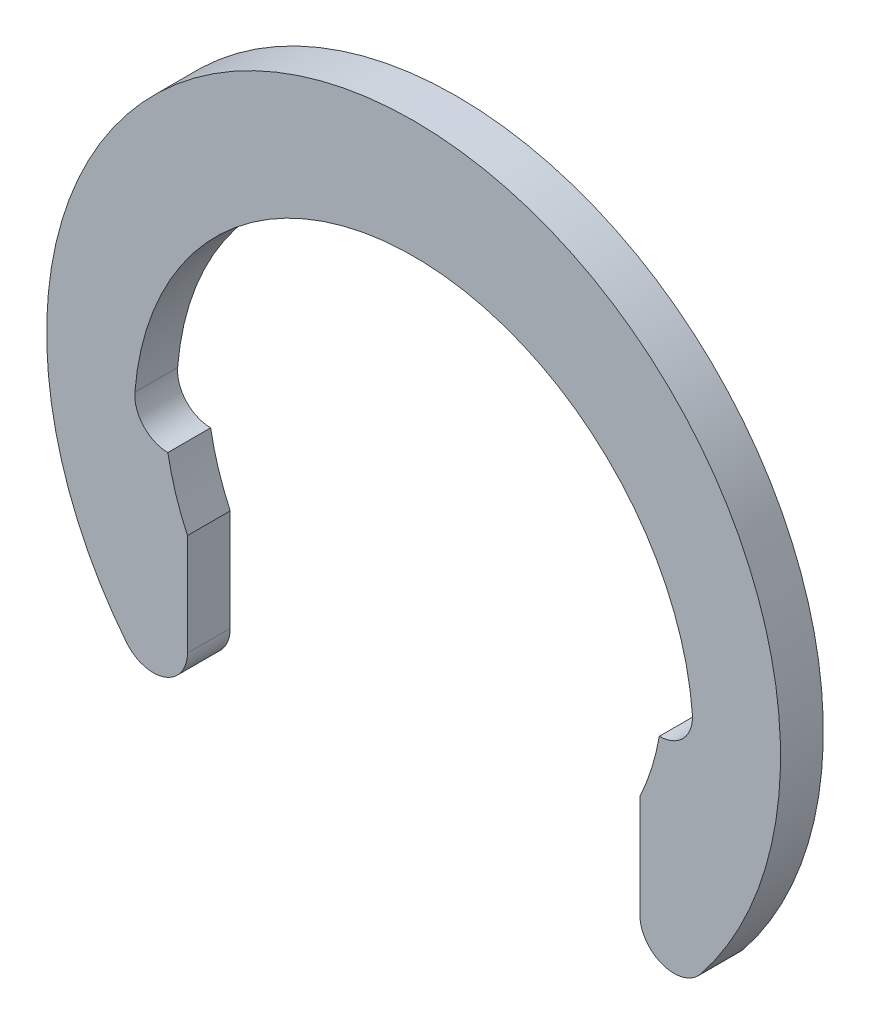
from build123d import *

# Parameters (mm, degrees)
BODY_DEPTH = 0.6


with BuildPart() as part:
    # BodySke → Body (new body)
    with BuildSketch(Plane.XY):
        with BuildLine():
            Line((3.172077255, -1.479163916), (3.172077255, -2.905816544))
            ThreePointArc((3.172077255, -2.905816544), (3.493794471, -3.358968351), (4.027687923, -3.204675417))
            ThreePointArc((4.027687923, -3.204675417), (0, 5.147058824), (-4.027687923, -3.204675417))
            ThreePointArc((-4.027687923, -3.204675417), (-3.493794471, -3.358968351), (-3.172077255, -2.905816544))
            Line((-3.172077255, -2.905816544), (-3.172077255, -1.479163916))
            ThreePointArc((-3.172077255, -1.479163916), (-3.338009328, -1.052470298), (-3.446827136, -0.607768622))
            ThreePointArc((-3.446827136, -0.607768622), (-3.788448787, -0.458090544), (-3.909997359, -0.105479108))
            ThreePointArc((-3.909997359, -0.105479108), (0, 3.5), (3.909997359, -0.105479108))
            ThreePointArc((3.909997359, -0.105479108), (3.788448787, -0.458090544), (3.446827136, -0.607768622))
            ThreePointArc((3.446827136, -0.607768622), (3.338009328, -1.052470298), (3.172077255, -1.479163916))
        make_face()
    extrude(amount=-BODY_DEPTH)


solid = part.part
